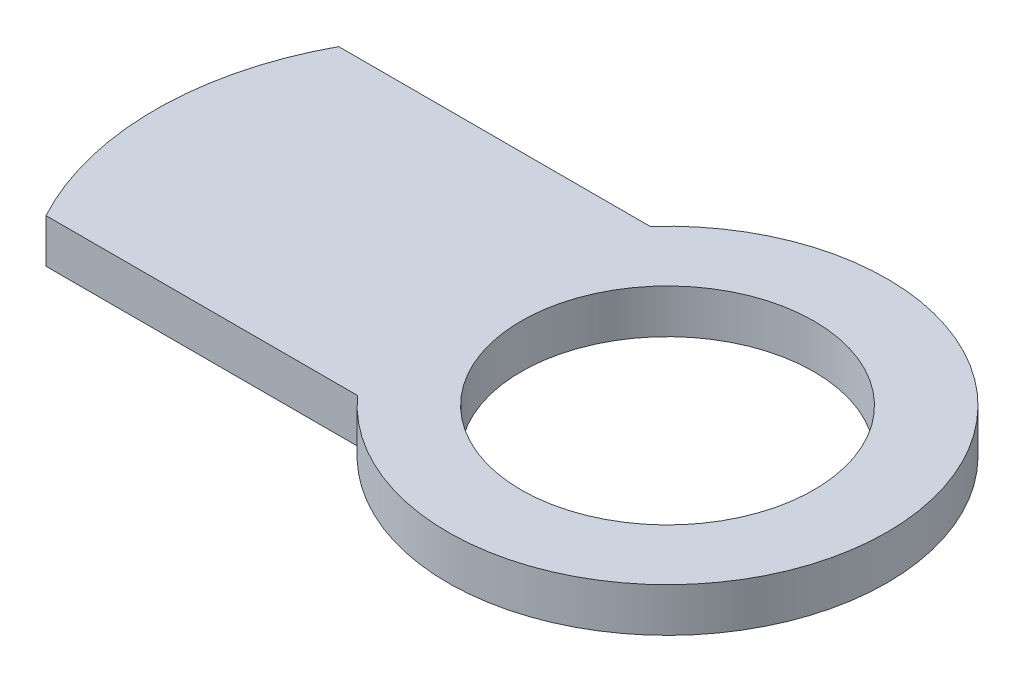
from build123d import *

# Parameters (mm, degrees)
SKETCH1_R      = 10
EXTRUDE1_DEPTH = 3


with BuildPart() as part:
    # Sketch1 → Extrude1 (new body)
    with BuildSketch(Plane(origin=(0, 0, 0), x_dir=(1, 0, 0), z_dir=(0, 1, 0))):
        with BuildLine():
            Line((-11.180339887, 10), (-32.466185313, 10))
            ThreePointArc((-32.466185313, 10), (-35, 0), (-32.466185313, -10))
            Line((-32.466185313, -10), (-11.180339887, -10))
            ThreePointArc((-11.180339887, -10), (15, 0), (-11.180339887, 10))
        make_face()
        with Locations(Location((0, 0, 0), (0, 0, 270))):
            Circle(SKETCH1_R, mode=Mode.SUBTRACT)
    extrude(amount=EXTRUDE1_DEPTH)


solid = part.part
